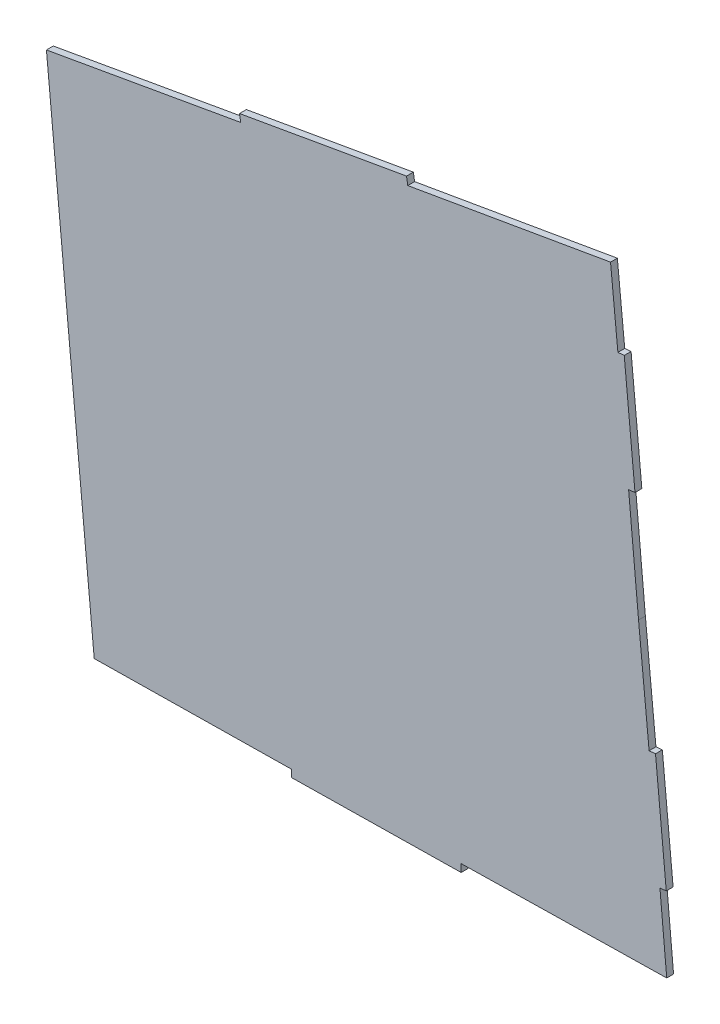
ISO-10303-21;
HEADER;
FILE_DESCRIPTION(('STEP AP214'),'2;1');
FILE_NAME('part.step','',(''),(''),'','','');
FILE_SCHEMA(('AUTOMOTIVE_DESIGN { 1 0 10303 214 1 1 1 1 }'));
ENDSEC;
DATA;
#1=APPLICATION_CONTEXT('core data for automotive mechanical design processes');
#2=APPLICATION_PROTOCOL_DEFINITION('international standard','automotive_design',2000,#1);
#3=PRODUCT_CONTEXT('',#1,'mechanical');
#4=PRODUCT('Part','Part','',(#3));
#5=PRODUCT_RELATED_PRODUCT_CATEGORY('part','',(#4));
#6=PRODUCT_DEFINITION_FORMATION('','',#4);
#7=PRODUCT_DEFINITION_CONTEXT('part definition',#1,'design');
#8=PRODUCT_DEFINITION('design','',#6,#7);
#9=PRODUCT_DEFINITION_SHAPE('','',#8);
#10=(LENGTH_UNIT() NAMED_UNIT(*) SI_UNIT(.MILLI.,.METRE.));
#11=(NAMED_UNIT(*) PLANE_ANGLE_UNIT() SI_UNIT($,.RADIAN.));
#12=(NAMED_UNIT(*) SI_UNIT($,.STERADIAN.) SOLID_ANGLE_UNIT());
#13=UNCERTAINTY_MEASURE_WITH_UNIT(LENGTH_MEASURE(1.E-05),#10,'distance_accuracy_value','');
#14=(GEOMETRIC_REPRESENTATION_CONTEXT(3) GLOBAL_UNCERTAINTY_ASSIGNED_CONTEXT((#13)) GLOBAL_UNIT_ASSIGNED_CONTEXT((#10,
#11,#12)) REPRESENTATION_CONTEXT('',''));
#15=CARTESIAN_POINT('',(0.,0.,0.));
#16=DIRECTION('',(0.,0.,1.));
#17=DIRECTION('',(1.,0.,0.));
#18=AXIS2_PLACEMENT_3D('',#15,#16,#17);
#19=CARTESIAN_POINT('',(70.1509980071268,0.690740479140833,1.524));
#20=DIRECTION('',(-0.0142121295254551,0.999899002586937,0.));
#21=DIRECTION('',(-0.999899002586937,-0.0142121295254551,0.));
#22=AXIS2_PLACEMENT_3D('',#19,#20,#21);
#23=PLANE('',#22);
#24=DIRECTION('',(0.999899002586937,0.0142121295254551,0.));
#25=VECTOR('',#24,1.);
#26=CARTESIAN_POINT('',(70.1509980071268,0.690740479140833,0.));
#27=LINE('',#26,#25);
#28=CARTESIAN_POINT('',(26.170197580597,0.065616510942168,0.));
#29=VERTEX_POINT('',#28);
#30=CARTESIAN_POINT('',(70.1509980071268,0.690740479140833,0.));
#31=VERTEX_POINT('',#30);
#32=EDGE_CURVE('E210',#29,#31,#27,.T.);
#33=ORIENTED_EDGE('',*,*,#32,.T.);
#34=DIRECTION('',(0.,0.,-1.));
#35=VECTOR('',#34,1.);
#36=CARTESIAN_POINT('',(70.1509980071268,0.690740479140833,1.524));
#37=LINE('',#36,#35);
#38=CARTESIAN_POINT('',(70.1509980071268,0.690740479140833,1.524));
#39=VERTEX_POINT('',#38);
#40=EDGE_CURVE('E11',#39,#31,#37,.T.);
#41=ORIENTED_EDGE('',*,*,#40,.F.);
#42=DIRECTION('',(0.999899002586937,0.0142121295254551,0.));
#43=VECTOR('',#42,1.);
#44=CARTESIAN_POINT('',(70.1509980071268,0.690740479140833,1.524));
#45=LINE('',#44,#43);
#46=CARTESIAN_POINT('',(26.170197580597,0.065616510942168,1.524));
#47=VERTEX_POINT('',#46);
#48=EDGE_CURVE('E250',#47,#39,#45,.T.);
#49=ORIENTED_EDGE('',*,*,#48,.F.);
#50=DIRECTION('',(0.,0.,-1.));
#51=VECTOR('',#50,1.);
#52=CARTESIAN_POINT('',(26.170197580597,0.065616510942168,1.524));
#53=LINE('',#52,#51);
#54=EDGE_CURVE('E206',#47,#29,#53,.T.);
#55=ORIENTED_EDGE('',*,*,#54,.T.);
#56=EDGE_LOOP('',(#33,#41,#49,#55));
#57=FACE_BOUND('',#56,.T.);
#58=ADVANCED_FACE('F36',(#57),#23,.F.);
#59=CARTESIAN_POINT('',(70.1509980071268,0.690740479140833,1.524));
#60=DIRECTION('',(0.999801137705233,0.0199420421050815,0.));
#61=DIRECTION('',(-0.0199420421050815,0.999801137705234,0.));
#62=AXIS2_PLACEMENT_3D('',#59,#60,#61);
#63=PLANE('',#62);
#64=DIRECTION('',(0.0199420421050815,-0.999801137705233,0.));
#65=VECTOR('',#64,1.);
#66=CARTESIAN_POINT('',(70.1509980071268,0.690740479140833,0.));
#67=LINE('',#66,#65);
#68=CARTESIAN_POINT('',(70.1831427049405,-0.920844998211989,0.));
#69=VERTEX_POINT('',#68);
#70=EDGE_CURVE('E213',#31,#69,#67,.T.);
#71=ORIENTED_EDGE('',*,*,#70,.T.);
#72=DIRECTION('',(0.,0.,-1.));
#73=VECTOR('',#72,1.);
#74=CARTESIAN_POINT('',(70.1831427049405,-0.920844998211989,1.524));
#75=LINE('',#74,#73);
#76=CARTESIAN_POINT('',(70.1831427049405,-0.920844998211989,1.524));
#77=VERTEX_POINT('',#76);
#78=EDGE_CURVE('E44',#77,#69,#75,.T.);
#79=ORIENTED_EDGE('',*,*,#78,.F.);
#80=DIRECTION('',(0.0199420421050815,-0.999801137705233,0.));
#81=VECTOR('',#80,1.);
#82=CARTESIAN_POINT('',(70.1509980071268,0.690740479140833,1.524));
#83=LINE('',#82,#81);
#84=EDGE_CURVE('E134',#39,#77,#83,.T.);
#85=ORIENTED_EDGE('',*,*,#84,.F.);
#86=ORIENTED_EDGE('',*,*,#40,.T.);
#87=EDGE_LOOP('',(#71,#79,#85,#86));
#88=FACE_BOUND('',#87,.T.);
#89=ADVANCED_FACE('F373',(#88),#63,.F.);
#90=CARTESIAN_POINT('',(70.1831427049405,-0.920844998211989,1.524));
#91=DIRECTION('',(-0.0154474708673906,0.999880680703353,0.));
#92=DIRECTION('',(-0.999880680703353,-0.0154474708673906,0.));
#93=AXIS2_PLACEMENT_3D('',#90,#91,#92);
#94=PLANE('',#93);
#95=DIRECTION('',(0.999880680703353,0.0154474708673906,0.));
#96=VECTOR('',#95,1.);
#97=CARTESIAN_POINT('',(70.1831427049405,-0.920844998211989,0.));
#98=LINE('',#97,#96);
#99=CARTESIAN_POINT('',(107.979031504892,-0.336924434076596,0.));
#100=VERTEX_POINT('',#99);
#101=EDGE_CURVE('E215',#69,#100,#98,.T.);
#102=ORIENTED_EDGE('',*,*,#101,.T.);
#103=DIRECTION('',(0.,0.,-1.));
#104=VECTOR('',#103,1.);
#105=CARTESIAN_POINT('',(107.979031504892,-0.336924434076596,1.524));
#106=LINE('',#105,#104);
#107=CARTESIAN_POINT('',(107.979031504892,-0.336924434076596,1.524));
#108=VERTEX_POINT('',#107);
#109=EDGE_CURVE('E296',#108,#100,#106,.T.);
#110=ORIENTED_EDGE('',*,*,#109,.F.);
#111=DIRECTION('',(0.999880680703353,0.0154474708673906,0.));
#112=VECTOR('',#111,1.);
#113=CARTESIAN_POINT('',(70.1831427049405,-0.920844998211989,1.524));
#114=LINE('',#113,#112);
#115=EDGE_CURVE('E304',#77,#108,#114,.T.);
#116=ORIENTED_EDGE('',*,*,#115,.F.);
#117=ORIENTED_EDGE('',*,*,#78,.T.);
#118=EDGE_LOOP('',(#102,#110,#116,#117));
#119=FACE_BOUND('',#118,.T.);
#120=ADVANCED_FACE('F302',(#119),#94,.F.);
#121=CARTESIAN_POINT('',(107.979031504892,-0.336924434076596,1.524));
#122=DIRECTION('',(-0.999710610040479,-0.0240561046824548,0.));
#123=DIRECTION('',(0.0240561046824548,-0.999710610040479,0.));
#124=AXIS2_PLACEMENT_3D('',#121,#122,#123);
#125=PLANE('',#124);
#126=DIRECTION('',(-0.0240561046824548,0.999710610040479,0.));
#127=VECTOR('',#126,1.);
#128=CARTESIAN_POINT('',(107.979031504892,-0.336924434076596,0.));
#129=LINE('',#128,#127);
#130=CARTESIAN_POINT('',(107.937724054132,1.37970830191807,0.));
#131=VERTEX_POINT('',#130);
#132=EDGE_CURVE('E217',#100,#131,#129,.T.);
#133=ORIENTED_EDGE('',*,*,#132,.T.);
#134=DIRECTION('',(0.,0.,-1.));
#135=VECTOR('',#134,1.);
#136=CARTESIAN_POINT('',(107.937724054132,1.37970830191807,1.524));
#137=LINE('',#136,#135);
#138=CARTESIAN_POINT('',(107.937724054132,1.37970830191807,1.524));
#139=VERTEX_POINT('',#138);
#140=EDGE_CURVE('E293',#139,#131,#137,.T.);
#141=ORIENTED_EDGE('',*,*,#140,.F.);
#142=DIRECTION('',(-0.0240561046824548,0.999710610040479,0.));
#143=VECTOR('',#142,1.);
#144=CARTESIAN_POINT('',(107.979031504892,-0.336924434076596,1.524));
#145=LINE('',#144,#143);
#146=EDGE_CURVE('E322',#108,#139,#145,.T.);
#147=ORIENTED_EDGE('',*,*,#146,.F.);
#148=ORIENTED_EDGE('',*,*,#109,.T.);
#149=EDGE_LOOP('',(#133,#141,#147,#148));
#150=FACE_BOUND('',#149,.T.);
#151=ADVANCED_FACE('F313',(#150),#125,.F.);
#152=CARTESIAN_POINT('',(107.937724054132,1.37970830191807,1.524));
#153=DIRECTION('',(-0.0180228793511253,0.999837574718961,0.));
#154=DIRECTION('',(-0.999837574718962,-0.0180228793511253,0.));
#155=AXIS2_PLACEMENT_3D('',#152,#153,#154);
#156=PLANE('',#155);
#157=DIRECTION('',(0.999837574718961,0.0180228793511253,0.));
#158=VECTOR('',#157,1.);
#159=CARTESIAN_POINT('',(107.937724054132,1.37970830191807,0.));
#160=LINE('',#159,#158);
#161=CARTESIAN_POINT('',(153.802534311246,2.20645852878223,0.));
#162=VERTEX_POINT('',#161);
#163=EDGE_CURVE('E219',#131,#162,#160,.T.);
#164=ORIENTED_EDGE('',*,*,#163,.T.);
#165=DIRECTION('',(0.,0.,-1.));
#166=VECTOR('',#165,1.);
#167=CARTESIAN_POINT('',(153.802534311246,2.20645852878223,1.524));
#168=LINE('',#167,#166);
#169=CARTESIAN_POINT('',(153.802534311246,2.20645852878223,1.524));
#170=VERTEX_POINT('',#169);
#171=EDGE_CURVE('E290',#170,#162,#168,.T.);
#172=ORIENTED_EDGE('',*,*,#171,.F.);
#173=DIRECTION('',(0.999837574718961,0.0180228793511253,0.));
#174=VECTOR('',#173,1.);
#175=CARTESIAN_POINT('',(107.937724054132,1.37970830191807,1.524));
#176=LINE('',#175,#174);
#177=EDGE_CURVE('E319',#139,#170,#176,.T.);
#178=ORIENTED_EDGE('',*,*,#177,.F.);
#179=ORIENTED_EDGE('',*,*,#140,.T.);
#180=EDGE_LOOP('',(#164,#172,#178,#179));
#181=FACE_BOUND('',#180,.T.);
#182=ADVANCED_FACE('F317',(#181),#156,.F.);
#183=CARTESIAN_POINT('',(152.287931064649,18.8280512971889,1.524));
#184=DIRECTION('',(-0.995874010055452,-0.0907466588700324,0.));
#185=DIRECTION('',(0.0907466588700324,-0.995874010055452,0.));
#186=AXIS2_PLACEMENT_3D('',#183,#184,#185);
#187=PLANE('',#186);
#188=DIRECTION('',(-0.0907466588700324,0.995874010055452,0.));
#189=VECTOR('',#188,1.);
#190=CARTESIAN_POINT('',(152.287931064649,18.8280512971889,0.));
#191=LINE('',#190,#189);
#192=CARTESIAN_POINT('',(152.287931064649,18.8280512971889,0.));
#193=VERTEX_POINT('',#192);
#194=EDGE_CURVE('E221',#162,#193,#191,.T.);
#195=ORIENTED_EDGE('',*,*,#194,.T.);
#196=DIRECTION('',(0.,0.,-1.));
#197=VECTOR('',#196,1.);
#198=CARTESIAN_POINT('',(152.287931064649,18.8280512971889,1.524));
#199=LINE('',#198,#197);
#200=CARTESIAN_POINT('',(152.287931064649,18.8280512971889,1.524));
#201=VERTEX_POINT('',#200);
#202=EDGE_CURVE('E287',#201,#193,#199,.T.);
#203=ORIENTED_EDGE('',*,*,#202,.F.);
#204=DIRECTION('',(-0.0907466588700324,0.995874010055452,0.));
#205=VECTOR('',#204,1.);
#206=CARTESIAN_POINT('',(152.287931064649,18.8280512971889,1.524));
#207=LINE('',#206,#205);
#208=EDGE_CURVE('E321',#170,#201,#207,.T.);
#209=ORIENTED_EDGE('',*,*,#208,.F.);
#210=ORIENTED_EDGE('',*,*,#171,.T.);
#211=EDGE_LOOP('',(#195,#203,#209,#210));
#212=FACE_BOUND('',#211,.T.);
#213=ADVANCED_FACE('F386',(#212),#187,.F.);
#214=CARTESIAN_POINT('',(152.287931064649,18.8280512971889,1.524));
#215=DIRECTION('',(-0.0945084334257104,0.995524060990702,0.));
#216=DIRECTION('',(-0.995524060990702,-0.0945084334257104,0.));
#217=AXIS2_PLACEMENT_3D('',#214,#215,#216);
#218=PLANE('',#217);
#219=DIRECTION('',(0.995524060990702,0.0945084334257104,0.));
#220=VECTOR('',#219,1.);
#221=CARTESIAN_POINT('',(152.287931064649,18.8280512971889,0.));
#222=LINE('',#221,#220);
#223=CARTESIAN_POINT('',(153.702750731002,18.9623648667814,0.));
#224=VERTEX_POINT('',#223);
#225=EDGE_CURVE('E223',#193,#224,#222,.T.);
#226=ORIENTED_EDGE('',*,*,#225,.T.);
#227=DIRECTION('',(0.,0.,-1.));
#228=VECTOR('',#227,1.);
#229=CARTESIAN_POINT('',(153.702750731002,18.9623648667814,1.524));
#230=LINE('',#229,#228);
#231=CARTESIAN_POINT('',(153.702750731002,18.9623648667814,1.524));
#232=VERTEX_POINT('',#231);
#233=EDGE_CURVE('E284',#232,#224,#230,.T.);
#234=ORIENTED_EDGE('',*,*,#233,.F.);
#235=DIRECTION('',(0.995524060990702,0.0945084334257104,0.));
#236=VECTOR('',#235,1.);
#237=CARTESIAN_POINT('',(152.287931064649,18.8280512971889,1.524));
#238=LINE('',#237,#236);
#239=EDGE_CURVE('E324',#201,#232,#238,.T.);
#240=ORIENTED_EDGE('',*,*,#239,.F.);
#241=ORIENTED_EDGE('',*,*,#202,.T.);
#242=EDGE_LOOP('',(#226,#234,#240,#241));
#243=FACE_BOUND('',#242,.T.);
#244=ADVANCED_FACE('F389',(#243),#218,.F.);
#245=CARTESIAN_POINT('',(153.702750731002,18.9623648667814,1.524));
#246=DIRECTION('',(-0.995524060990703,-0.0945084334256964,0.));
#247=DIRECTION('',(0.0945084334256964,-0.995524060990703,0.));
#248=AXIS2_PLACEMENT_3D('',#245,#246,#247);
#249=PLANE('',#248);
#250=DIRECTION('',(-0.0945084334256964,0.995524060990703,0.));
#251=VECTOR('',#250,1.);
#252=CARTESIAN_POINT('',(153.702750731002,18.9623648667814,0.));
#253=LINE('',#252,#251);
#254=CARTESIAN_POINT('',(151.302236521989,44.2486760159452,0.));
#255=VERTEX_POINT('',#254);
#256=EDGE_CURVE('E225',#224,#255,#253,.T.);
#257=ORIENTED_EDGE('',*,*,#256,.T.);
#258=DIRECTION('',(0.,0.,-1.));
#259=VECTOR('',#258,1.);
#260=CARTESIAN_POINT('',(151.302236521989,44.2486760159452,1.524));
#261=LINE('',#260,#259);
#262=CARTESIAN_POINT('',(151.302236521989,44.2486760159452,1.524));
#263=VERTEX_POINT('',#262);
#264=EDGE_CURVE('E281',#263,#255,#261,.T.);
#265=ORIENTED_EDGE('',*,*,#264,.F.);
#266=DIRECTION('',(-0.0945084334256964,0.995524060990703,0.));
#267=VECTOR('',#266,1.);
#268=CARTESIAN_POINT('',(153.702750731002,18.9623648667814,1.524));
#269=LINE('',#268,#267);
#270=EDGE_CURVE('E330',#232,#263,#269,.T.);
#271=ORIENTED_EDGE('',*,*,#270,.F.);
#272=ORIENTED_EDGE('',*,*,#233,.T.);
#273=EDGE_LOOP('',(#257,#265,#271,#272));
#274=FACE_BOUND('',#273,.T.);
#275=ADVANCED_FACE('F393',(#274),#249,.F.);
#276=CARTESIAN_POINT('',(151.302236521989,44.2486760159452,1.524));
#277=DIRECTION('',(0.0945084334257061,-0.995524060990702,0.));
#278=DIRECTION('',(0.995524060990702,0.0945084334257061,0.));
#279=AXIS2_PLACEMENT_3D('',#276,#277,#278);
#280=PLANE('',#279);
#281=DIRECTION('',(-0.995524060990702,-0.0945084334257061,0.));
#282=VECTOR('',#281,1.);
#283=CARTESIAN_POINT('',(151.302236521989,44.2486760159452,0.));
#284=LINE('',#283,#282);
#285=CARTESIAN_POINT('',(149.875498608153,44.1132310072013,0.));
#286=VERTEX_POINT('',#285);
#287=EDGE_CURVE('E227',#255,#286,#284,.T.);
#288=ORIENTED_EDGE('',*,*,#287,.T.);
#289=DIRECTION('',(0.,0.,-1.));
#290=VECTOR('',#289,1.);
#291=CARTESIAN_POINT('',(149.875498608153,44.1132310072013,1.524));
#292=LINE('',#291,#290);
#293=CARTESIAN_POINT('',(149.875498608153,44.1132310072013,1.524));
#294=VERTEX_POINT('',#293);
#295=EDGE_CURVE('E278',#294,#286,#292,.T.);
#296=ORIENTED_EDGE('',*,*,#295,.F.);
#297=DIRECTION('',(-0.995524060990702,-0.0945084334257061,0.));
#298=VECTOR('',#297,1.);
#299=CARTESIAN_POINT('',(151.302236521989,44.2486760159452,1.524));
#300=LINE('',#299,#298);
#301=EDGE_CURVE('E332',#263,#294,#300,.T.);
#302=ORIENTED_EDGE('',*,*,#301,.F.);
#303=ORIENTED_EDGE('',*,*,#264,.T.);
#304=EDGE_LOOP('',(#288,#296,#302,#303));
#305=FACE_BOUND('',#304,.T.);
#306=ADVANCED_FACE('F397',(#305),#280,.F.);
#307=CARTESIAN_POINT('',(147.519677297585,68.178790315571,1.524));
#308=DIRECTION('',(-0.995242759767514,-0.0974261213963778,0.));
#309=DIRECTION('',(0.0974261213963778,-0.995242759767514,0.));
#310=AXIS2_PLACEMENT_3D('',#307,#308,#309);
#311=PLANE('',#310);
#312=DIRECTION('',(-0.0974261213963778,0.995242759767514,0.));
#313=VECTOR('',#312,1.);
#314=CARTESIAN_POINT('',(147.519677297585,68.178790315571,0.));
#315=LINE('',#314,#313);
#316=CARTESIAN_POINT('',(147.519677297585,68.178790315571,0.));
#317=VERTEX_POINT('',#316);
#318=EDGE_CURVE('E229',#286,#317,#315,.T.);
#319=ORIENTED_EDGE('',*,*,#318,.T.);
#320=DIRECTION('',(0.,0.,-1.));
#321=VECTOR('',#320,1.);
#322=CARTESIAN_POINT('',(147.519677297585,68.178790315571,1.524));
#323=LINE('',#322,#321);
#324=CARTESIAN_POINT('',(147.519677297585,68.178790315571,1.524));
#325=VERTEX_POINT('',#324);
#326=EDGE_CURVE('E275',#325,#317,#323,.T.);
#327=ORIENTED_EDGE('',*,*,#326,.F.);
#328=DIRECTION('',(-0.0974261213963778,0.995242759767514,0.));
#329=VECTOR('',#328,1.);
#330=CARTESIAN_POINT('',(147.519677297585,68.178790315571,1.524));
#331=LINE('',#330,#329);
#332=EDGE_CURVE('E334',#294,#325,#331,.T.);
#333=ORIENTED_EDGE('',*,*,#332,.F.);
#334=ORIENTED_EDGE('',*,*,#295,.T.);
#335=EDGE_LOOP('',(#319,#327,#333,#334));
#336=FACE_BOUND('',#335,.T.);
#337=ADVANCED_FACE('F401',(#336),#311,.F.);
#338=CARTESIAN_POINT('',(147.519677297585,68.178790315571,1.524));
#339=DIRECTION('',(-0.995796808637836,-0.0915899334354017,0.));
#340=DIRECTION('',(0.0915899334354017,-0.995796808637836,0.));
#341=AXIS2_PLACEMENT_3D('',#338,#339,#340);
#342=PLANE('',#341);
#343=DIRECTION('',(-0.0915899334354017,0.995796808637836,0.));
#344=VECTOR('',#343,1.);
#345=CARTESIAN_POINT('',(147.519677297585,68.178790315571,0.));
#346=LINE('',#345,#344);
#347=CARTESIAN_POINT('',(145.304978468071,92.2577468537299,0.));
#348=VERTEX_POINT('',#347);
#349=EDGE_CURVE('E231',#317,#348,#346,.T.);
#350=ORIENTED_EDGE('',*,*,#349,.T.);
#351=DIRECTION('',(0.,0.,-1.));
#352=VECTOR('',#351,1.);
#353=CARTESIAN_POINT('',(145.304978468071,92.2577468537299,1.524));
#354=LINE('',#353,#352);
#355=CARTESIAN_POINT('',(145.304978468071,92.2577468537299,1.524));
#356=VERTEX_POINT('',#355);
#357=EDGE_CURVE('E272',#356,#348,#354,.T.);
#358=ORIENTED_EDGE('',*,*,#357,.F.);
#359=DIRECTION('',(-0.0915899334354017,0.995796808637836,0.));
#360=VECTOR('',#359,1.);
#361=CARTESIAN_POINT('',(147.519677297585,68.178790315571,1.524));
#362=LINE('',#361,#360);
#363=EDGE_CURVE('E336',#325,#356,#362,.T.);
#364=ORIENTED_EDGE('',*,*,#363,.F.);
#365=ORIENTED_EDGE('',*,*,#326,.T.);
#366=EDGE_LOOP('',(#350,#358,#364,#365));
#367=FACE_BOUND('',#366,.T.);
#368=ADVANCED_FACE('F405',(#367),#342,.F.);
#369=CARTESIAN_POINT('',(146.731716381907,92.3931918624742,1.524));
#370=DIRECTION('',(-0.0945084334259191,0.995524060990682,0.));
#371=DIRECTION('',(-0.995524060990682,-0.0945084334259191,0.));
#372=AXIS2_PLACEMENT_3D('',#369,#370,#371);
#373=PLANE('',#372);
#374=DIRECTION('',(0.995524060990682,0.0945084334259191,0.));
#375=VECTOR('',#374,1.);
#376=CARTESIAN_POINT('',(146.731716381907,92.3931918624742,0.));
#377=LINE('',#376,#375);
#378=CARTESIAN_POINT('',(146.731716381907,92.3931918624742,0.));
#379=VERTEX_POINT('',#378);
#380=EDGE_CURVE('E233',#348,#379,#377,.T.);
#381=ORIENTED_EDGE('',*,*,#380,.T.);
#382=DIRECTION('',(0.,0.,-1.));
#383=VECTOR('',#382,1.);
#384=CARTESIAN_POINT('',(146.731716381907,92.3931918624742,1.524));
#385=LINE('',#384,#383);
#386=CARTESIAN_POINT('',(146.731716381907,92.3931918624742,1.524));
#387=VERTEX_POINT('',#386);
#388=EDGE_CURVE('E269',#387,#379,#385,.T.);
#389=ORIENTED_EDGE('',*,*,#388,.F.);
#390=DIRECTION('',(0.995524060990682,0.0945084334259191,0.));
#391=VECTOR('',#390,1.);
#392=CARTESIAN_POINT('',(146.731716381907,92.3931918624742,1.524));
#393=LINE('',#392,#391);
#394=EDGE_CURVE('E338',#356,#387,#393,.T.);
#395=ORIENTED_EDGE('',*,*,#394,.F.);
#396=ORIENTED_EDGE('',*,*,#357,.T.);
#397=EDGE_LOOP('',(#381,#389,#395,#396));
#398=FACE_BOUND('',#397,.T.);
#399=ADVANCED_FACE('F409',(#398),#373,.F.);
#400=CARTESIAN_POINT('',(144.331202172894,117.679503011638,1.524));
#401=DIRECTION('',(-0.995524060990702,-0.0945084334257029,0.));
#402=DIRECTION('',(0.0945084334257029,-0.995524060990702,0.));
#403=AXIS2_PLACEMENT_3D('',#400,#401,#402);
#404=PLANE('',#403);
#405=DIRECTION('',(-0.0945084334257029,0.995524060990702,0.));
#406=VECTOR('',#405,1.);
#407=CARTESIAN_POINT('',(144.331202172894,117.679503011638,0.));
#408=LINE('',#407,#406);
#409=CARTESIAN_POINT('',(144.331202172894,117.679503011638,0.));
#410=VERTEX_POINT('',#409);
#411=EDGE_CURVE('E235',#379,#410,#408,.T.);
#412=ORIENTED_EDGE('',*,*,#411,.T.);
#413=DIRECTION('',(0.,0.,-1.));
#414=VECTOR('',#413,1.);
#415=CARTESIAN_POINT('',(144.331202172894,117.679503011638,1.524));
#416=LINE('',#415,#414);
#417=CARTESIAN_POINT('',(144.331202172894,117.679503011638,1.524));
#418=VERTEX_POINT('',#417);
#419=EDGE_CURVE('E266',#418,#410,#416,.T.);
#420=ORIENTED_EDGE('',*,*,#419,.F.);
#421=DIRECTION('',(-0.0945084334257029,0.995524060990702,0.));
#422=VECTOR('',#421,1.);
#423=CARTESIAN_POINT('',(144.331202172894,117.679503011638,1.524));
#424=LINE('',#423,#422);
#425=EDGE_CURVE('E340',#387,#418,#424,.T.);
#426=ORIENTED_EDGE('',*,*,#425,.F.);
#427=ORIENTED_EDGE('',*,*,#388,.T.);
#428=EDGE_LOOP('',(#412,#420,#426,#427));
#429=FACE_BOUND('',#428,.T.);
#430=ADVANCED_FACE('F413',(#429),#404,.F.);
#431=CARTESIAN_POINT('',(142.916382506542,117.545189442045,1.524));
#432=DIRECTION('',(0.0945084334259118,-0.995524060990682,0.));
#433=DIRECTION('',(0.995524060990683,0.0945084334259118,0.));
#434=AXIS2_PLACEMENT_3D('',#431,#432,#433);
#435=PLANE('',#434);
#436=DIRECTION('',(-0.995524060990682,-0.0945084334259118,0.));
#437=VECTOR('',#436,1.);
#438=CARTESIAN_POINT('',(142.916382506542,117.545189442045,0.));
#439=LINE('',#438,#437);
#440=CARTESIAN_POINT('',(142.916382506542,117.545189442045,0.));
#441=VERTEX_POINT('',#440);
#442=EDGE_CURVE('E237',#410,#441,#439,.T.);
#443=ORIENTED_EDGE('',*,*,#442,.T.);
#444=DIRECTION('',(0.,0.,-1.));
#445=VECTOR('',#444,1.);
#446=CARTESIAN_POINT('',(142.916382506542,117.545189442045,1.524));
#447=LINE('',#446,#445);
#448=CARTESIAN_POINT('',(142.916382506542,117.545189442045,1.524));
#449=VERTEX_POINT('',#448);
#450=EDGE_CURVE('E263',#449,#441,#447,.T.);
#451=ORIENTED_EDGE('',*,*,#450,.F.);
#452=DIRECTION('',(-0.995524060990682,-0.0945084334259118,0.));
#453=VECTOR('',#452,1.);
#454=CARTESIAN_POINT('',(142.916382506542,117.545189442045,1.524));
#455=LINE('',#454,#453);
#456=EDGE_CURVE('E342',#418,#449,#455,.T.);
#457=ORIENTED_EDGE('',*,*,#456,.F.);
#458=ORIENTED_EDGE('',*,*,#419,.T.);
#459=EDGE_LOOP('',(#443,#451,#457,#458));
#460=FACE_BOUND('',#459,.T.);
#461=ADVANCED_FACE('F417',(#460),#435,.F.);
#462=CARTESIAN_POINT('',(142.916382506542,117.545189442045,1.524));
#463=DIRECTION('',(-0.99515990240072,-0.0982688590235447,0.));
#464=DIRECTION('',(0.0982688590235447,-0.99515990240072,0.));
#465=AXIS2_PLACEMENT_3D('',#462,#463,#464);
#466=PLANE('',#465);
#467=DIRECTION('',(-0.0982688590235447,0.99515990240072,0.));
#468=VECTOR('',#467,1.);
#469=CARTESIAN_POINT('',(142.916382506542,117.545189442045,0.));
#470=LINE('',#469,#468);
#471=CARTESIAN_POINT('',(141.276230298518,134.154863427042,0.));
#472=VERTEX_POINT('',#471);
#473=EDGE_CURVE('E239',#441,#472,#470,.T.);
#474=ORIENTED_EDGE('',*,*,#473,.T.);
#475=DIRECTION('',(0.,0.,-1.));
#476=VECTOR('',#475,1.);
#477=CARTESIAN_POINT('',(141.276230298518,134.154863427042,1.524));
#478=LINE('',#477,#476);
#479=CARTESIAN_POINT('',(141.276230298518,134.154863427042,1.524));
#480=VERTEX_POINT('',#479);
#481=EDGE_CURVE('E260',#480,#472,#478,.T.);
#482=ORIENTED_EDGE('',*,*,#481,.F.);
#483=DIRECTION('',(-0.0982688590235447,0.99515990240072,0.));
#484=VECTOR('',#483,1.);
#485=CARTESIAN_POINT('',(142.916382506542,117.545189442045,1.524));
#486=LINE('',#485,#484);
#487=EDGE_CURVE('E344',#449,#480,#486,.T.);
#488=ORIENTED_EDGE('',*,*,#487,.F.);
#489=ORIENTED_EDGE('',*,*,#450,.T.);
#490=EDGE_LOOP('',(#474,#482,#488,#489));
#491=FACE_BOUND('',#490,.T.);
#492=ADVANCED_FACE('F421',(#491),#466,.F.);
#493=CARTESIAN_POINT('',(96.0751644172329,126.336425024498,1.524));
#494=DIRECTION('',(0.170439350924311,-0.985368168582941,0.));
#495=DIRECTION('',(0.985368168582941,0.170439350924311,0.));
#496=AXIS2_PLACEMENT_3D('',#493,#494,#495);
#497=PLANE('',#496);
#498=DIRECTION('',(-0.985368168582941,-0.170439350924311,0.));
#499=VECTOR('',#498,1.);
#500=CARTESIAN_POINT('',(96.0751644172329,126.336425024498,0.));
#501=LINE('',#500,#499);
#502=CARTESIAN_POINT('',(96.0751644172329,126.336425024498,0.));
#503=VERTEX_POINT('',#502);
#504=EDGE_CURVE('E241',#472,#503,#501,.T.);
#505=ORIENTED_EDGE('',*,*,#504,.T.);
#506=DIRECTION('',(0.,0.,-1.));
#507=VECTOR('',#506,1.);
#508=CARTESIAN_POINT('',(96.0751644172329,126.336425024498,1.524));
#509=LINE('',#508,#507);
#510=CARTESIAN_POINT('',(96.0751644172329,126.336425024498,1.524));
#511=VERTEX_POINT('',#510);
#512=EDGE_CURVE('E257',#511,#503,#509,.T.);
#513=ORIENTED_EDGE('',*,*,#512,.F.);
#514=DIRECTION('',(-0.985368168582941,-0.170439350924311,0.));
#515=VECTOR('',#514,1.);
#516=CARTESIAN_POINT('',(96.0751644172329,126.336425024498,1.524));
#517=LINE('',#516,#515);
#518=EDGE_CURVE('E346',#480,#511,#517,.T.);
#519=ORIENTED_EDGE('',*,*,#518,.F.);
#520=ORIENTED_EDGE('',*,*,#481,.T.);
#521=EDGE_LOOP('',(#505,#513,#519,#520));
#522=FACE_BOUND('',#521,.T.);
#523=ADVANCED_FACE('F425',(#522),#497,.F.);
#524=CARTESIAN_POINT('',(95.792713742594,128.030165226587,1.524));
#525=DIRECTION('',(-0.98637874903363,-0.164490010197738,0.));
#526=DIRECTION('',(0.164490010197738,-0.98637874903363,0.));
#527=AXIS2_PLACEMENT_3D('',#524,#525,#526);
#528=PLANE('',#527);
#529=DIRECTION('',(-0.164490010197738,0.98637874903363,0.));
#530=VECTOR('',#529,1.);
#531=CARTESIAN_POINT('',(95.792713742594,128.030165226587,0.));
#532=LINE('',#531,#530);
#533=CARTESIAN_POINT('',(95.792713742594,128.030165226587,0.));
#534=VERTEX_POINT('',#533);
#535=EDGE_CURVE('E243',#503,#534,#532,.T.);
#536=ORIENTED_EDGE('',*,*,#535,.T.);
#537=DIRECTION('',(0.,0.,-1.));
#538=VECTOR('',#537,1.);
#539=CARTESIAN_POINT('',(95.792713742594,128.030165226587,1.524));
#540=LINE('',#539,#538);
#541=CARTESIAN_POINT('',(95.792713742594,128.030165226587,1.524));
#542=VERTEX_POINT('',#541);
#543=EDGE_CURVE('E254',#542,#534,#540,.T.);
#544=ORIENTED_EDGE('',*,*,#543,.F.);
#545=DIRECTION('',(-0.164490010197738,0.98637874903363,0.));
#546=VECTOR('',#545,1.);
#547=CARTESIAN_POINT('',(95.792713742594,128.030165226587,1.524));
#548=LINE('',#547,#546);
#549=EDGE_CURVE('E348',#511,#542,#548,.T.);
#550=ORIENTED_EDGE('',*,*,#549,.F.);
#551=ORIENTED_EDGE('',*,*,#512,.T.);
#552=EDGE_LOOP('',(#536,#544,#550,#551));
#553=FACE_BOUND('',#552,.T.);
#554=ADVANCED_FACE('F354',(#553),#528,.F.);
#555=CARTESIAN_POINT('',(58.5621220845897,121.491570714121,1.524));
#556=DIRECTION('',(0.172976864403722,-0.984925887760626,0.));
#557=DIRECTION('',(0.984925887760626,0.172976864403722,0.));
#558=AXIS2_PLACEMENT_3D('',#555,#556,#557);
#559=PLANE('',#558);
#560=DIRECTION('',(-0.984925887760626,-0.172976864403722,0.));
#561=VECTOR('',#560,1.);
#562=CARTESIAN_POINT('',(58.5621220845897,121.491570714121,0.));
#563=LINE('',#562,#561);
#564=CARTESIAN_POINT('',(58.5621220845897,121.491570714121,0.));
#565=VERTEX_POINT('',#564);
#566=EDGE_CURVE('E245',#534,#565,#563,.T.);
#567=ORIENTED_EDGE('',*,*,#566,.T.);
#568=DIRECTION('',(0.,0.,-1.));
#569=VECTOR('',#568,1.);
#570=CARTESIAN_POINT('',(58.5621220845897,121.491570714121,1.524));
#571=LINE('',#570,#569);
#572=CARTESIAN_POINT('',(58.5621220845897,121.491570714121,1.524));
#573=VERTEX_POINT('',#572);
#574=EDGE_CURVE('E201',#573,#565,#571,.T.);
#575=ORIENTED_EDGE('',*,*,#574,.F.);
#576=DIRECTION('',(-0.984925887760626,-0.172976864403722,0.));
#577=VECTOR('',#576,1.);
#578=CARTESIAN_POINT('',(58.5621220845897,121.491570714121,1.524));
#579=LINE('',#578,#577);
#580=EDGE_CURVE('E192',#542,#573,#579,.T.);
#581=ORIENTED_EDGE('',*,*,#580,.F.);
#582=ORIENTED_EDGE('',*,*,#543,.T.);
#583=EDGE_LOOP('',(#567,#575,#581,#582));
#584=FACE_BOUND('',#583,.T.);
#585=ADVANCED_FACE('F358',(#584),#559,.F.);
#586=CARTESIAN_POINT('',(58.8338050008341,119.902725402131,1.524));
#587=DIRECTION('',(0.985693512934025,0.168547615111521,0.));
#588=DIRECTION('',(-0.168547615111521,0.985693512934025,0.));
#589=AXIS2_PLACEMENT_3D('',#586,#587,#588);
#590=PLANE('',#589);
#591=DIRECTION('',(0.168547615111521,-0.985693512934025,0.));
#592=VECTOR('',#591,1.);
#593=CARTESIAN_POINT('',(58.8338050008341,119.902725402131,0.));
#594=LINE('',#593,#592);
#595=CARTESIAN_POINT('',(58.8338050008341,119.902725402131,0.));
#596=VERTEX_POINT('',#595);
#597=EDGE_CURVE('E200',#565,#596,#594,.T.);
#598=ORIENTED_EDGE('',*,*,#597,.T.);
#599=DIRECTION('',(0.,0.,-1.));
#600=VECTOR('',#599,1.);
#601=CARTESIAN_POINT('',(58.8338050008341,119.902725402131,1.524));
#602=LINE('',#601,#600);
#603=CARTESIAN_POINT('',(58.8338050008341,119.902725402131,1.524));
#604=VERTEX_POINT('',#603);
#605=EDGE_CURVE('E197',#604,#596,#602,.T.);
#606=ORIENTED_EDGE('',*,*,#605,.F.);
#607=DIRECTION('',(0.168547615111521,-0.985693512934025,0.));
#608=VECTOR('',#607,1.);
#609=CARTESIAN_POINT('',(58.8338050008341,119.902725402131,1.524));
#610=LINE('',#609,#608);
#611=EDGE_CURVE('E186',#573,#604,#610,.T.);
#612=ORIENTED_EDGE('',*,*,#611,.F.);
#613=ORIENTED_EDGE('',*,*,#574,.T.);
#614=EDGE_LOOP('',(#598,#606,#612,#613));
#615=FACE_BOUND('',#614,.T.);
#616=ADVANCED_FACE('F198',(#615),#590,.F.);
#617=CARTESIAN_POINT('',(58.8338050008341,119.902725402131,1.524));
#618=DIRECTION('',(0.174193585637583,-0.984711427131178,0.));
#619=DIRECTION('',(0.984711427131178,0.174193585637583,0.));
#620=AXIS2_PLACEMENT_3D('',#617,#618,#619);
#621=PLANE('',#620);
#622=DIRECTION('',(-0.984711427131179,-0.174193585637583,0.));
#623=VECTOR('',#622,1.);
#624=CARTESIAN_POINT('',(58.8338050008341,119.902725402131,0.));
#625=LINE('',#624,#623);
#626=CARTESIAN_POINT('',(15.5210337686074,112.240778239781,0.));
#627=VERTEX_POINT('',#626);
#628=EDGE_CURVE('E120',#596,#627,#625,.T.);
#629=ORIENTED_EDGE('',*,*,#628,.T.);
#630=DIRECTION('',(0.,0.,-1.));
#631=VECTOR('',#630,1.);
#632=CARTESIAN_POINT('',(15.5210337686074,112.240778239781,1.524));
#633=LINE('',#632,#631);
#634=CARTESIAN_POINT('',(15.5210337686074,112.240778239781,1.524));
#635=VERTEX_POINT('',#634);
#636=EDGE_CURVE('E202',#635,#627,#633,.T.);
#637=ORIENTED_EDGE('',*,*,#636,.F.);
#638=DIRECTION('',(-0.984711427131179,-0.174193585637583,0.));
#639=VECTOR('',#638,1.);
#640=CARTESIAN_POINT('',(58.8338050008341,119.902725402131,1.524));
#641=LINE('',#640,#639);
#642=EDGE_CURVE('E190',#604,#635,#641,.T.);
#643=ORIENTED_EDGE('',*,*,#642,.F.);
#644=ORIENTED_EDGE('',*,*,#605,.T.);
#645=EDGE_LOOP('',(#629,#637,#643,#644));
#646=FACE_BOUND('',#645,.T.);
#647=ADVANCED_FACE('F204',(#646),#621,.F.);
#648=CARTESIAN_POINT('',(26.170197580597,0.065616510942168,1.524));
#649=DIRECTION('',(0.995524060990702,0.0945084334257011,0.));
#650=DIRECTION('',(-0.0945084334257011,0.995524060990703,0.));
#651=AXIS2_PLACEMENT_3D('',#648,#649,#650);
#652=PLANE('',#651);
#653=DIRECTION('',(0.0945084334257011,-0.995524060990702,0.));
#654=VECTOR('',#653,1.);
#655=CARTESIAN_POINT('',(26.170197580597,0.065616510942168,0.));
#656=LINE('',#655,#654);
#657=EDGE_CURVE('E126',#627,#29,#656,.T.);
#658=ORIENTED_EDGE('',*,*,#657,.T.);
#659=ORIENTED_EDGE('',*,*,#54,.F.);
#660=DIRECTION('',(0.0945084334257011,-0.995524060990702,0.));
#661=VECTOR('',#660,1.);
#662=CARTESIAN_POINT('',(26.170197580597,0.065616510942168,1.524));
#663=LINE('',#662,#661);
#664=EDGE_CURVE('E52',#635,#47,#663,.T.);
#665=ORIENTED_EDGE('',*,*,#664,.F.);
#666=ORIENTED_EDGE('',*,*,#636,.T.);
#667=EDGE_LOOP('',(#658,#659,#665,#666));
#668=FACE_BOUND('',#667,.T.);
#669=ADVANCED_FACE('F362',(#668),#652,.F.);
#670=CARTESIAN_POINT('',(0.,0.,1.524));
#671=DIRECTION('',(0.,0.,1.));
#672=DIRECTION('',(1.,0.,0.));
#673=AXIS2_PLACEMENT_3D('',#670,#671,#672);
#674=PLANE('',#673);
#675=ORIENTED_EDGE('',*,*,#48,.T.);
#676=ORIENTED_EDGE('',*,*,#84,.T.);
#677=ORIENTED_EDGE('',*,*,#115,.T.);
#678=ORIENTED_EDGE('',*,*,#146,.T.);
#679=ORIENTED_EDGE('',*,*,#177,.T.);
#680=ORIENTED_EDGE('',*,*,#208,.T.);
#681=ORIENTED_EDGE('',*,*,#239,.T.);
#682=ORIENTED_EDGE('',*,*,#270,.T.);
#683=ORIENTED_EDGE('',*,*,#301,.T.);
#684=ORIENTED_EDGE('',*,*,#332,.T.);
#685=ORIENTED_EDGE('',*,*,#363,.T.);
#686=ORIENTED_EDGE('',*,*,#394,.T.);
#687=ORIENTED_EDGE('',*,*,#425,.T.);
#688=ORIENTED_EDGE('',*,*,#456,.T.);
#689=ORIENTED_EDGE('',*,*,#487,.T.);
#690=ORIENTED_EDGE('',*,*,#518,.T.);
#691=ORIENTED_EDGE('',*,*,#549,.T.);
#692=ORIENTED_EDGE('',*,*,#580,.T.);
#693=ORIENTED_EDGE('',*,*,#611,.T.);
#694=ORIENTED_EDGE('',*,*,#642,.T.);
#695=ORIENTED_EDGE('',*,*,#664,.T.);
#696=EDGE_LOOP('',(#675,#676,#677,#678,#679,#680,#681,#682,#683,#684,#685,#686,#687,#688,#689,
#690,#691,#692,#693,#694,#695));
#697=FACE_BOUND('',#696,.T.);
#698=ADVANCED_FACE('F188',(#697),#674,.T.);
#699=CARTESIAN_POINT('',(0.,0.,0.));
#700=DIRECTION('',(0.,0.,1.));
#701=DIRECTION('',(1.,0.,0.));
#702=AXIS2_PLACEMENT_3D('',#699,#700,#701);
#703=PLANE('',#702);
#704=ORIENTED_EDGE('',*,*,#32,.F.);
#705=ORIENTED_EDGE('',*,*,#657,.F.);
#706=ORIENTED_EDGE('',*,*,#628,.F.);
#707=ORIENTED_EDGE('',*,*,#597,.F.);
#708=ORIENTED_EDGE('',*,*,#566,.F.);
#709=ORIENTED_EDGE('',*,*,#535,.F.);
#710=ORIENTED_EDGE('',*,*,#504,.F.);
#711=ORIENTED_EDGE('',*,*,#473,.F.);
#712=ORIENTED_EDGE('',*,*,#442,.F.);
#713=ORIENTED_EDGE('',*,*,#411,.F.);
#714=ORIENTED_EDGE('',*,*,#380,.F.);
#715=ORIENTED_EDGE('',*,*,#349,.F.);
#716=ORIENTED_EDGE('',*,*,#318,.F.);
#717=ORIENTED_EDGE('',*,*,#287,.F.);
#718=ORIENTED_EDGE('',*,*,#256,.F.);
#719=ORIENTED_EDGE('',*,*,#225,.F.);
#720=ORIENTED_EDGE('',*,*,#194,.F.);
#721=ORIENTED_EDGE('',*,*,#163,.F.);
#722=ORIENTED_EDGE('',*,*,#132,.F.);
#723=ORIENTED_EDGE('',*,*,#101,.F.);
#724=ORIENTED_EDGE('',*,*,#70,.F.);
#725=EDGE_LOOP('',(#704,#705,#706,#707,#708,#709,#710,#711,#712,#713,#714,#715,#716,#717,#718,
#719,#720,#721,#722,#723,#724));
#726=FACE_BOUND('',#725,.T.);
#727=ADVANCED_FACE('F308',(#726),#703,.F.);
#728=CLOSED_SHELL('',(#58,#89,#120,#151,#182,#213,#244,#275,#306,#337,#368,#399,#430,#461,#492,
#523,#554,#585,#616,#647,#669,#698,#727));
#729=MANIFOLD_SOLID_BREP('B2',#728);
#730=ADVANCED_BREP_SHAPE_REPRESENTATION('',(#18,#729),#14);
#731=SHAPE_DEFINITION_REPRESENTATION(#9,#730);
ENDSEC;
END-ISO-10303-21;
